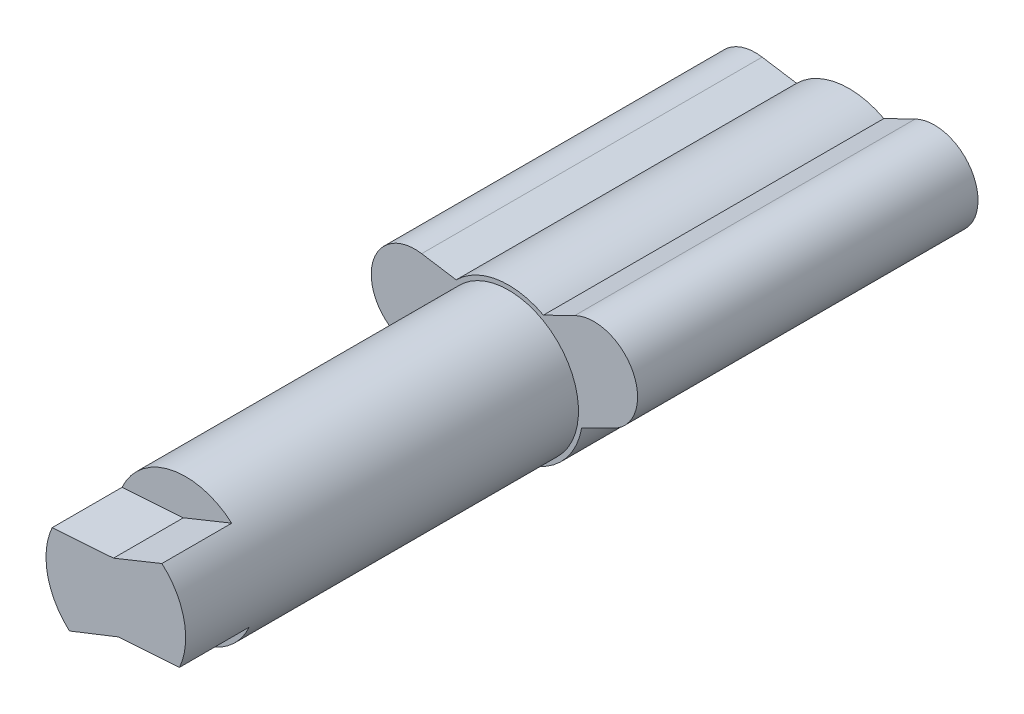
ISO-10303-21;
HEADER;
FILE_DESCRIPTION(('STEP AP214'),'2;1');
FILE_NAME('part.step','',(''),(''),'','','');
FILE_SCHEMA(('AUTOMOTIVE_DESIGN { 1 0 10303 214 1 1 1 1 }'));
ENDSEC;
DATA;
#1=APPLICATION_CONTEXT('core data for automotive mechanical design processes');
#2=APPLICATION_PROTOCOL_DEFINITION('international standard','automotive_design',2000,#1);
#3=PRODUCT_CONTEXT('',#1,'mechanical');
#4=PRODUCT('Part','Part','',(#3));
#5=PRODUCT_RELATED_PRODUCT_CATEGORY('part','',(#4));
#6=PRODUCT_DEFINITION_FORMATION('','',#4);
#7=PRODUCT_DEFINITION_CONTEXT('part definition',#1,'design');
#8=PRODUCT_DEFINITION('design','',#6,#7);
#9=PRODUCT_DEFINITION_SHAPE('','',#8);
#10=(LENGTH_UNIT() NAMED_UNIT(*) SI_UNIT(.MILLI.,.METRE.));
#11=(NAMED_UNIT(*) PLANE_ANGLE_UNIT() SI_UNIT($,.RADIAN.));
#12=(NAMED_UNIT(*) SI_UNIT($,.STERADIAN.) SOLID_ANGLE_UNIT());
#13=UNCERTAINTY_MEASURE_WITH_UNIT(LENGTH_MEASURE(1.E-05),#10,'distance_accuracy_value','');
#14=(GEOMETRIC_REPRESENTATION_CONTEXT(3) GLOBAL_UNCERTAINTY_ASSIGNED_CONTEXT((#13)) GLOBAL_UNIT_ASSIGNED_CONTEXT((#10,
#11,#12)) REPRESENTATION_CONTEXT('',''));
#15=CARTESIAN_POINT('',(0.,0.,0.));
#16=DIRECTION('',(0.,0.,1.));
#17=DIRECTION('',(1.,0.,0.));
#18=AXIS2_PLACEMENT_3D('',#15,#16,#17);
#19=CARTESIAN_POINT('',(-1.72084568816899E-12,6.35602681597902E-12,41.9999999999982));
#20=DIRECTION('',(0.,0.,-0.99999999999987));
#21=DIRECTION('',(-1.0000000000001,0.,0.));
#22=AXIS2_PLACEMENT_3D('',#19,#20,#21);
#23=CYLINDRICAL_SURFACE('',#22,4.);
#24=CARTESIAN_POINT('',(-1.72084568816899E-12,6.35602681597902E-12,41.9999999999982));
#25=DIRECTION('',(0.,0.,0.99999999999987));
#26=DIRECTION('',(1.0000000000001,0.,0.));
#27=AXIS2_PLACEMENT_3D('',#24,#25,#26);
#28=CIRCLE('',#27,4.);
#29=CARTESIAN_POINT('',(-3.64734960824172,1.64220608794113,41.9999999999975));
#30=VERTEX_POINT('',#29);
#31=CARTESIAN_POINT('',(-2.65782858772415,-2.98930547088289,41.9999999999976));
#32=VERTEX_POINT('',#31);
#33=EDGE_CURVE('E258',#30,#32,#28,.T.);
#34=ORIENTED_EDGE('',*,*,#33,.F.);
#35=DIRECTION('',(0.,0.,0.99999999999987));
#36=VECTOR('',#35,1.);
#37=CARTESIAN_POINT('',(-3.64734960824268,1.64220608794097,37.9999999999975));
#38=LINE('',#37,#36);
#39=CARTESIAN_POINT('',(-3.64734960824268,1.64220608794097,37.9999999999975));
#40=VERTEX_POINT('',#39);
#41=EDGE_CURVE('E236',#40,#30,#38,.T.);
#42=ORIENTED_EDGE('',*,*,#41,.F.);
#43=CARTESIAN_POINT('',(-1.81105130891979E-12,1.88737914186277E-12,37.9999999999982));
#44=DIRECTION('',(0.,0.,0.99999999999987));
#45=DIRECTION('',(-1.0000000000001,0.,0.));
#46=AXIS2_PLACEMENT_3D('',#43,#44,#45);
#47=CIRCLE('',#46,4.00000000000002);
#48=CARTESIAN_POINT('',(2.63845152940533,3.00642204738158,37.9999999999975));
#49=VERTEX_POINT('',#48);
#50=EDGE_CURVE('E232',#49,#40,#47,.T.);
#51=ORIENTED_EDGE('',*,*,#50,.F.);
#52=DIRECTION('',(0.,0.,0.99999999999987));
#53=VECTOR('',#52,1.);
#54=CARTESIAN_POINT('',(2.63845152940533,3.00642204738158,37.9999999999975));
#55=LINE('',#54,#53);
#56=CARTESIAN_POINT('',(2.63845152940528,3.00642204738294,41.9999999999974));
#57=VERTEX_POINT('',#56);
#58=EDGE_CURVE('E239',#49,#57,#55,.T.);
#59=ORIENTED_EDGE('',*,*,#58,.T.);
#60=CARTESIAN_POINT('',(3.64734960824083,-1.64220608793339,41.9999999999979));
#61=VERTEX_POINT('',#60);
#62=EDGE_CURVE('E54',#61,#57,#28,.T.);
#63=ORIENTED_EDGE('',*,*,#62,.F.);
#64=DIRECTION('',(0.,0.,0.99999999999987));
#65=VECTOR('',#64,1.);
#66=CARTESIAN_POINT('',(3.64734960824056,-1.64220608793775,37.9999999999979));
#67=LINE('',#66,#65);
#68=CARTESIAN_POINT('',(3.64734960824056,-1.64220608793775,37.9999999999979));
#69=VERTEX_POINT('',#68);
#70=EDGE_CURVE('E69',#69,#61,#67,.T.);
#71=ORIENTED_EDGE('',*,*,#70,.F.);
#72=CARTESIAN_POINT('',(-1.81105130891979E-12,1.88737914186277E-12,37.9999999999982));
#73=DIRECTION('',(0.,0.,0.99999999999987));
#74=DIRECTION('',(1.0000000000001,0.,0.));
#75=AXIS2_PLACEMENT_3D('',#72,#73,#74);
#76=CIRCLE('',#75,3.99999999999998);
#77=CARTESIAN_POINT('',(-2.65782858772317,-2.98930547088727,37.9999999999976));
#78=VERTEX_POINT('',#77);
#79=EDGE_CURVE('E250',#78,#69,#76,.T.);
#80=ORIENTED_EDGE('',*,*,#79,.F.);
#81=DIRECTION('',(0.,0.,0.99999999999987));
#82=VECTOR('',#81,1.);
#83=CARTESIAN_POINT('',(-2.65782858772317,-2.98930547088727,37.9999999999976));
#84=LINE('',#83,#82);
#85=EDGE_CURVE('E255',#78,#32,#84,.T.);
#86=ORIENTED_EDGE('',*,*,#85,.T.);
#87=EDGE_LOOP('',(#34,#42,#51,#59,#63,#71,#80,#86));
#88=FACE_BOUND('',#87,.T.);
#89=CARTESIAN_POINT('',(3.19189119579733E-13,-4.71844785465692E-13,19.499999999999));
#90=DIRECTION('',(0.,0.,-0.99999999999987));
#91=DIRECTION('',(-1.0000000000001,0.,0.));
#92=AXIS2_PLACEMENT_3D('',#89,#90,#91);
#93=CIRCLE('',#92,4.);
#94=CARTESIAN_POINT('',(-4.00000000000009,-4.48974191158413E-13,19.499999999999));
#95=VERTEX_POINT('',#94);
#96=EDGE_CURVE('E13',#95,#95,#93,.T.);
#97=ORIENTED_EDGE('',*,*,#96,.F.);
#98=EDGE_LOOP('',(#97));
#99=FACE_BOUND('',#98,.T.);
#100=ADVANCED_FACE('F47',(#88,#99),#23,.T.);
#101=CARTESIAN_POINT('',(-1.72084568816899E-12,6.35602681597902E-12,41.9999999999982));
#102=DIRECTION('',(0.,0.,0.99999999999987));
#103=DIRECTION('',(1.0000000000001,0.,0.));
#104=AXIS2_PLACEMENT_3D('',#101,#102,#103);
#105=PLANE('',#104);
#106=DIRECTION('',(0.997564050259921,0.0697564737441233,0.));
#107=VECTOR('',#106,1.);
#108=CARTESIAN_POINT('',(-0.132023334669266,1.88802164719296,41.9999999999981));
#109=LINE('',#108,#107);
#110=CARTESIAN_POINT('',(-0.132023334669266,1.88802164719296,41.9999999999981));
#111=VERTEX_POINT('',#110);
#112=EDGE_CURVE('E61',#30,#111,#109,.T.);
#113=ORIENTED_EDGE('',*,*,#112,.F.);
#114=ORIENTED_EDGE('',*,*,#33,.T.);
#115=DIRECTION('',(-0.930152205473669,-0.367174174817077,0.));
#116=VECTOR('',#115,1.);
#117=CARTESIAN_POINT('',(0.132023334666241,-1.88802164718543,41.9999999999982));
#118=LINE('',#117,#116);
#119=CARTESIAN_POINT('',(0.132023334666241,-1.88802164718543,41.9999999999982));
#120=VERTEX_POINT('',#119);
#121=EDGE_CURVE('E238',#120,#32,#118,.T.);
#122=ORIENTED_EDGE('',*,*,#121,.F.);
#123=DIRECTION('',(-0.997564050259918,-0.0697564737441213,0.));
#124=VECTOR('',#123,1.);
#125=CARTESIAN_POINT('',(0.132023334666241,-1.88802164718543,41.9999999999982));
#126=LINE('',#125,#124);
#127=EDGE_CURVE('E245',#61,#120,#126,.T.);
#128=ORIENTED_EDGE('',*,*,#127,.F.);
#129=ORIENTED_EDGE('',*,*,#62,.T.);
#130=DIRECTION('',(0.927293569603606,0.374334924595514,0.));
#131=VECTOR('',#130,1.);
#132=CARTESIAN_POINT('',(-0.132023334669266,1.88802164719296,41.9999999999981));
#133=LINE('',#132,#131);
#134=EDGE_CURVE('E224',#111,#57,#133,.T.);
#135=ORIENTED_EDGE('',*,*,#134,.F.);
#136=EDGE_LOOP('',(#113,#114,#122,#128,#129,#135));
#137=FACE_BOUND('',#136,.T.);
#138=ADVANCED_FACE('F267',(#137),#105,.T.);
#139=CARTESIAN_POINT('',(0.132023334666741,-1.8880216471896,37.9999999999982));
#140=DIRECTION('',(-0.367174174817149,0.930152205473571,0.));
#141=DIRECTION('',(-0.930152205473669,-0.367174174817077,0.));
#142=AXIS2_PLACEMENT_3D('',#139,#140,#141);
#143=PLANE('',#142);
#144=ORIENTED_EDGE('',*,*,#121,.T.);
#145=ORIENTED_EDGE('',*,*,#85,.F.);
#146=DIRECTION('',(-0.930152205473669,-0.367174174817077,0.));
#147=VECTOR('',#146,1.);
#148=CARTESIAN_POINT('',(0.132023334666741,-1.8880216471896,37.9999999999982));
#149=LINE('',#148,#147);
#150=CARTESIAN_POINT('',(0.132023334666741,-1.8880216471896,37.9999999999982));
#151=VERTEX_POINT('',#150);
#152=EDGE_CURVE('E247',#151,#78,#149,.T.);
#153=ORIENTED_EDGE('',*,*,#152,.F.);
#154=DIRECTION('',(0.,0.,0.99999999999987));
#155=VECTOR('',#154,1.);
#156=CARTESIAN_POINT('',(0.132023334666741,-1.8880216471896,37.9999999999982));
#157=LINE('',#156,#155);
#158=EDGE_CURVE('E256',#151,#120,#157,.T.);
#159=ORIENTED_EDGE('',*,*,#158,.T.);
#160=EDGE_LOOP('',(#144,#145,#153,#159));
#161=FACE_BOUND('',#160,.T.);
#162=ADVANCED_FACE('F271',(#161),#143,.F.);
#163=CARTESIAN_POINT('',(0.132023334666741,-1.8880216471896,37.9999999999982));
#164=DIRECTION('',(-0.0697564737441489,0.997564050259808,0.));
#165=DIRECTION('',(-0.997564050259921,-0.0697564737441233,0.));
#166=AXIS2_PLACEMENT_3D('',#163,#164,#165);
#167=PLANE('',#166);
#168=ORIENTED_EDGE('',*,*,#127,.T.);
#169=ORIENTED_EDGE('',*,*,#158,.F.);
#170=DIRECTION('',(-0.997564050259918,-0.0697564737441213,0.));
#171=VECTOR('',#170,1.);
#172=CARTESIAN_POINT('',(0.132023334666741,-1.8880216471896,37.9999999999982));
#173=LINE('',#172,#171);
#174=EDGE_CURVE('E252',#69,#151,#173,.T.);
#175=ORIENTED_EDGE('',*,*,#174,.F.);
#176=ORIENTED_EDGE('',*,*,#70,.T.);
#177=EDGE_LOOP('',(#168,#169,#175,#176));
#178=FACE_BOUND('',#177,.T.);
#179=ADVANCED_FACE('F277',(#178),#167,.F.);
#180=CARTESIAN_POINT('',(-1.81105130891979E-12,1.88737914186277E-12,37.9999999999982));
#181=DIRECTION('',(0.,0.,0.99999999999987));
#182=DIRECTION('',(1.0000000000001,0.,0.));
#183=AXIS2_PLACEMENT_3D('',#180,#181,#182);
#184=PLANE('',#183);
#185=ORIENTED_EDGE('',*,*,#152,.T.);
#186=ORIENTED_EDGE('',*,*,#79,.T.);
#187=ORIENTED_EDGE('',*,*,#174,.T.);
#188=EDGE_LOOP('',(#185,#186,#187));
#189=FACE_BOUND('',#188,.T.);
#190=ADVANCED_FACE('F276',(#189),#184,.T.);
#191=CARTESIAN_POINT('',(-0.132023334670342,1.88802164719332,37.9999999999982));
#192=DIRECTION('',(0.0697564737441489,-0.997564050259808,0.));
#193=DIRECTION('',(0.997564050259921,0.0697564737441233,0.));
#194=AXIS2_PLACEMENT_3D('',#191,#192,#193);
#195=PLANE('',#194);
#196=ORIENTED_EDGE('',*,*,#112,.T.);
#197=DIRECTION('',(0.,0.,0.99999999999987));
#198=VECTOR('',#197,1.);
#199=CARTESIAN_POINT('',(-0.132023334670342,1.88802164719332,37.9999999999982));
#200=LINE('',#199,#198);
#201=CARTESIAN_POINT('',(-0.132023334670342,1.88802164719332,37.9999999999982));
#202=VERTEX_POINT('',#201);
#203=EDGE_CURVE('E235',#202,#111,#200,.T.);
#204=ORIENTED_EDGE('',*,*,#203,.F.);
#205=DIRECTION('',(0.997564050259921,0.0697564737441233,0.));
#206=VECTOR('',#205,1.);
#207=CARTESIAN_POINT('',(-0.132023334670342,1.88802164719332,37.9999999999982));
#208=LINE('',#207,#206);
#209=EDGE_CURVE('E226',#40,#202,#208,.T.);
#210=ORIENTED_EDGE('',*,*,#209,.F.);
#211=ORIENTED_EDGE('',*,*,#41,.T.);
#212=EDGE_LOOP('',(#196,#204,#210,#211));
#213=FACE_BOUND('',#212,.T.);
#214=ADVANCED_FACE('F284',(#213),#195,.F.);
#215=CARTESIAN_POINT('',(-0.132023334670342,1.88802164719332,37.9999999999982));
#216=DIRECTION('',(0.37433492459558,-0.92729356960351,0.));
#217=DIRECTION('',(0.927293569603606,0.374334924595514,0.));
#218=AXIS2_PLACEMENT_3D('',#215,#216,#217);
#219=PLANE('',#218);
#220=ORIENTED_EDGE('',*,*,#134,.T.);
#221=ORIENTED_EDGE('',*,*,#58,.F.);
#222=DIRECTION('',(0.927293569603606,0.374334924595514,0.));
#223=VECTOR('',#222,1.);
#224=CARTESIAN_POINT('',(-0.132023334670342,1.88802164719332,37.9999999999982));
#225=LINE('',#224,#223);
#226=EDGE_CURVE('E229',#202,#49,#225,.T.);
#227=ORIENTED_EDGE('',*,*,#226,.F.);
#228=ORIENTED_EDGE('',*,*,#203,.T.);
#229=EDGE_LOOP('',(#220,#221,#227,#228));
#230=FACE_BOUND('',#229,.T.);
#231=ADVANCED_FACE('F281',(#230),#219,.F.);
#232=CARTESIAN_POINT('',(-1.81105130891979E-12,1.88737914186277E-12,37.9999999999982));
#233=DIRECTION('',(0.,0.,-0.99999999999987));
#234=DIRECTION('',(-1.0000000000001,0.,0.));
#235=AXIS2_PLACEMENT_3D('',#232,#233,#234);
#236=PLANE('',#235);
#237=ORIENTED_EDGE('',*,*,#209,.T.);
#238=ORIENTED_EDGE('',*,*,#226,.T.);
#239=ORIENTED_EDGE('',*,*,#50,.T.);
#240=EDGE_LOOP('',(#237,#238,#239));
#241=FACE_BOUND('',#240,.T.);
#242=ADVANCED_FACE('F283',(#241),#236,.F.);
#243=CARTESIAN_POINT('',(3.19189119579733E-13,-4.71844785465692E-13,19.499999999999));
#244=DIRECTION('',(0.,0.,-0.99999999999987));
#245=DIRECTION('',(-1.0000000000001,0.,0.));
#246=AXIS2_PLACEMENT_3D('',#243,#244,#245);
#247=PLANE('',#246);
#248=CARTESIAN_POINT('',(3.19189119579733E-13,-4.71844785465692E-13,19.499999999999));
#249=DIRECTION('',(0.,0.,-0.99999999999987));
#250=DIRECTION('',(-1.0000000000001,0.,0.));
#251=AXIS2_PLACEMENT_3D('',#248,#249,#250);
#252=CIRCLE('',#251,4.25);
#253=CARTESIAN_POINT('',(4.18533999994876,-0.738531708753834,19.4999999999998));
#254=VERTEX_POINT('',#253);
#255=CARTESIAN_POINT('',(-3.78487172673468,-1.93319580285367,19.5000000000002));
#256=VERTEX_POINT('',#255);
#257=EDGE_CURVE('E156',#254,#256,#252,.T.);
#258=ORIENTED_EDGE('',*,*,#257,.F.);
#259=DIRECTION('',(-0.898605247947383,-0.438758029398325,0.));
#260=VECTOR('',#259,1.);
#261=CARTESIAN_POINT('',(4.18533999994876,-0.738531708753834,19.4999999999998));
#262=LINE('',#261,#260);
#263=CARTESIAN_POINT('',(5.98255049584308,0.13898435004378,19.4999999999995));
#264=VERTEX_POINT('',#263);
#265=EDGE_CURVE('E161',#264,#254,#262,.T.);
#266=ORIENTED_EDGE('',*,*,#265,.F.);
#267=CARTESIAN_POINT('',(4.88565542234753,2.38549746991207,19.499999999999));
#268=DIRECTION('',(0.,0.,-0.99999999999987));
#269=DIRECTION('',(1.0000000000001,0.,0.));
#270=AXIS2_PLACEMENT_3D('',#267,#268,#269);
#271=CIRCLE('',#270,2.5);
#272=CARTESIAN_POINT('',(3.78876034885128,4.6320105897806,19.4999999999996));
#273=VERTEX_POINT('',#272);
#274=EDGE_CURVE('E205',#273,#264,#271,.T.);
#275=ORIENTED_EDGE('',*,*,#274,.F.);
#276=DIRECTION('',(0.898605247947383,0.438758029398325,0.));
#277=VECTOR('',#276,1.);
#278=CARTESIAN_POINT('',(3.78876034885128,4.6320105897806,19.4999999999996));
#279=LINE('',#278,#277);
#280=CARTESIAN_POINT('',(1.99154985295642,3.75449453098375,19.4999999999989));
#281=VERTEX_POINT('',#280);
#282=EDGE_CURVE('E202',#281,#273,#279,.T.);
#283=ORIENTED_EDGE('',*,*,#282,.F.);
#284=CARTESIAN_POINT('',(3.19189119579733E-13,-4.71844785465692E-13,19.499999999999));
#285=DIRECTION('',(0.,0.,-0.99999999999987));
#286=DIRECTION('',(-1.0000000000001,0.,0.));
#287=AXIS2_PLACEMENT_3D('',#284,#285,#286);
#288=CIRCLE('',#287,4.25);
#289=CARTESIAN_POINT('',(-3.00482543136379,3.00558216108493,19.499999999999));
#290=VERTEX_POINT('',#289);
#291=EDGE_CURVE('E199',#290,#281,#288,.T.);
#292=ORIENTED_EDGE('',*,*,#291,.F.);
#293=DIRECTION('',(0.987755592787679,-0.156009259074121,0.));
#294=VECTOR('',#293,1.);
#295=CARTESIAN_POINT('',(-3.00482543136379,3.00558216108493,19.499999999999));
#296=LINE('',#295,#294);
#297=CARTESIAN_POINT('',(-4.98033661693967,3.31760067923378,19.499999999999));
#298=VERTEX_POINT('',#297);
#299=EDGE_CURVE('E196',#298,#290,#296,.T.);
#300=ORIENTED_EDGE('',*,*,#299,.F.);
#301=CARTESIAN_POINT('',(-5.37035976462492,0.848211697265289,19.499999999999));
#302=DIRECTION('',(0.,0.,-0.99999999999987));
#303=DIRECTION('',(1.0000000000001,0.,0.));
#304=AXIS2_PLACEMENT_3D('',#301,#302,#303);
#305=CIRCLE('',#304,2.5);
#306=CARTESIAN_POINT('',(-5.7603829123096,-1.62117728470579,19.5000000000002));
#307=VERTEX_POINT('',#306);
#308=EDGE_CURVE('E193',#307,#298,#305,.T.);
#309=ORIENTED_EDGE('',*,*,#308,.F.);
#310=DIRECTION('',(-0.98775559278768,0.156009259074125,0.));
#311=VECTOR('',#310,1.);
#312=CARTESIAN_POINT('',(-5.7603829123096,-1.62117728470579,19.5000000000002));
#313=LINE('',#312,#311);
#314=EDGE_CURVE('E191',#256,#307,#313,.T.);
#315=ORIENTED_EDGE('',*,*,#314,.F.);
#316=EDGE_LOOP('',(#258,#266,#275,#283,#292,#300,#309,#315));
#317=FACE_BOUND('',#316,.T.);
#318=ORIENTED_EDGE('',*,*,#96,.T.);
#319=EDGE_LOOP('',(#318));
#320=FACE_BOUND('',#319,.T.);
#321=ADVANCED_FACE('F325',(#317,#320),#247,.F.);
#322=CARTESIAN_POINT('',(3.19189119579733E-13,-4.71844785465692E-13,19.499999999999));
#323=DIRECTION('',(0.,0.,-0.99999999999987));
#324=DIRECTION('',(-1.0000000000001,0.,0.));
#325=AXIS2_PLACEMENT_3D('',#322,#323,#324);
#326=CYLINDRICAL_SURFACE('',#325,4.25);
#327=CARTESIAN_POINT('',(0.,0.,0.));
#328=DIRECTION('',(0.,0.,-0.99999999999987));
#329=DIRECTION('',(-1.0000000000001,0.,0.));
#330=AXIS2_PLACEMENT_3D('',#327,#328,#329);
#331=CIRCLE('',#330,4.25);
#332=CARTESIAN_POINT('',(4.1853399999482,-0.738531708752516,3.41393580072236E-12));
#333=VERTEX_POINT('',#332);
#334=CARTESIAN_POINT('',(-3.78487172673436,-1.93319580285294,3.05311331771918E-12));
#335=VERTEX_POINT('',#334);
#336=EDGE_CURVE('E153',#333,#335,#331,.T.);
#337=ORIENTED_EDGE('',*,*,#336,.F.);
#338=DIRECTION('',(0.,0.,-0.99999999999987));
#339=VECTOR('',#338,1.);
#340=CARTESIAN_POINT('',(4.18533999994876,-0.738531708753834,19.4999999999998));
#341=LINE('',#340,#339);
#342=EDGE_CURVE('E210',#254,#333,#341,.T.);
#343=ORIENTED_EDGE('',*,*,#342,.F.);
#344=ORIENTED_EDGE('',*,*,#257,.T.);
#345=DIRECTION('',(0.,0.,-0.99999999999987));
#346=VECTOR('',#345,1.);
#347=CARTESIAN_POINT('',(-3.78487172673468,-1.93319580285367,19.5000000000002));
#348=LINE('',#347,#346);
#349=EDGE_CURVE('E149',#256,#335,#348,.T.);
#350=ORIENTED_EDGE('',*,*,#349,.T.);
#351=EDGE_LOOP('',(#337,#343,#344,#350));
#352=FACE_BOUND('',#351,.T.);
#353=ADVANCED_FACE('F151',(#352),#326,.T.);
#354=CARTESIAN_POINT('',(4.18533999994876,-0.738531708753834,19.4999999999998));
#355=DIRECTION('',(0.438758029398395,-0.898605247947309,0.));
#356=DIRECTION('',(0.898605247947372,0.438758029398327,0.));
#357=AXIS2_PLACEMENT_3D('',#354,#355,#356);
#358=PLANE('',#357);
#359=DIRECTION('',(-0.898605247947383,-0.438758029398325,0.));
#360=VECTOR('',#359,1.);
#361=CARTESIAN_POINT('',(4.1853399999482,-0.738531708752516,3.41393580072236E-12));
#362=LINE('',#361,#360);
#363=CARTESIAN_POINT('',(5.98255049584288,0.138984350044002,3.37230243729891E-12));
#364=VERTEX_POINT('',#363);
#365=EDGE_CURVE('E174',#364,#333,#362,.T.);
#366=ORIENTED_EDGE('',*,*,#365,.F.);
#367=DIRECTION('',(0.,0.,-0.99999999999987));
#368=VECTOR('',#367,1.);
#369=CARTESIAN_POINT('',(5.98255049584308,0.13898435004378,19.4999999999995));
#370=LINE('',#369,#368);
#371=EDGE_CURVE('E212',#264,#364,#370,.T.);
#372=ORIENTED_EDGE('',*,*,#371,.F.);
#373=ORIENTED_EDGE('',*,*,#265,.T.);
#374=ORIENTED_EDGE('',*,*,#342,.T.);
#375=EDGE_LOOP('',(#366,#372,#373,#374));
#376=FACE_BOUND('',#375,.T.);
#377=ADVANCED_FACE('F342',(#376),#358,.T.);
#378=CARTESIAN_POINT('',(4.88565542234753,2.38549746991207,19.499999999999));
#379=DIRECTION('',(0.,0.,-0.99999999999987));
#380=DIRECTION('',(-1.0000000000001,0.,0.));
#381=AXIS2_PLACEMENT_3D('',#378,#379,#380);
#382=CYLINDRICAL_SURFACE('',#381,2.5);
#383=CARTESIAN_POINT('',(4.88565542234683,2.38549746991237,5.27355936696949E-13));
#384=DIRECTION('',(0.,0.,-0.99999999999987));
#385=DIRECTION('',(1.0000000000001,0.,0.));
#386=AXIS2_PLACEMENT_3D('',#383,#384,#385);
#387=CIRCLE('',#386,2.5);
#388=CARTESIAN_POINT('',(3.7887603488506,4.63201058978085,1.11022302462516E-13));
#389=VERTEX_POINT('',#388);
#390=EDGE_CURVE('E187',#389,#364,#387,.T.);
#391=ORIENTED_EDGE('',*,*,#390,.F.);
#392=DIRECTION('',(0.,0.,-0.99999999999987));
#393=VECTOR('',#392,1.);
#394=CARTESIAN_POINT('',(3.78876034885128,4.6320105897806,19.4999999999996));
#395=LINE('',#394,#393);
#396=EDGE_CURVE('E214',#273,#389,#395,.T.);
#397=ORIENTED_EDGE('',*,*,#396,.F.);
#398=ORIENTED_EDGE('',*,*,#274,.T.);
#399=ORIENTED_EDGE('',*,*,#371,.T.);
#400=EDGE_LOOP('',(#391,#397,#398,#399));
#401=FACE_BOUND('',#400,.T.);
#402=ADVANCED_FACE('F349',(#401),#382,.T.);
#403=CARTESIAN_POINT('',(3.78876034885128,4.6320105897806,19.4999999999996));
#404=DIRECTION('',(-0.438758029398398,0.898605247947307,0.));
#405=DIRECTION('',(-0.898605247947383,-0.438758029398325,0.));
#406=AXIS2_PLACEMENT_3D('',#403,#404,#405);
#407=PLANE('',#406);
#408=DIRECTION('',(0.898605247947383,0.438758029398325,0.));
#409=VECTOR('',#408,1.);
#410=CARTESIAN_POINT('',(3.7887603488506,4.63201058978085,1.11022302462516E-13));
#411=LINE('',#410,#409);
#412=CARTESIAN_POINT('',(1.99154985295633,3.75449453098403,3.02535774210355E-12));
#413=VERTEX_POINT('',#412);
#414=EDGE_CURVE('E184',#413,#389,#411,.T.);
#415=ORIENTED_EDGE('',*,*,#414,.F.);
#416=DIRECTION('',(0.,0.,-0.99999999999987));
#417=VECTOR('',#416,1.);
#418=CARTESIAN_POINT('',(1.99154985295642,3.75449453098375,19.4999999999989));
#419=LINE('',#418,#417);
#420=EDGE_CURVE('E216',#281,#413,#419,.T.);
#421=ORIENTED_EDGE('',*,*,#420,.F.);
#422=ORIENTED_EDGE('',*,*,#282,.T.);
#423=ORIENTED_EDGE('',*,*,#396,.T.);
#424=EDGE_LOOP('',(#415,#421,#422,#423));
#425=FACE_BOUND('',#424,.T.);
#426=ADVANCED_FACE('F357',(#425),#407,.T.);
#427=CARTESIAN_POINT('',(3.19189119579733E-13,-4.71844785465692E-13,19.499999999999));
#428=DIRECTION('',(0.,0.,-0.99999999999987));
#429=DIRECTION('',(-1.0000000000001,0.,0.));
#430=AXIS2_PLACEMENT_3D('',#427,#428,#429);
#431=CYLINDRICAL_SURFACE('',#430,4.25);
#432=CARTESIAN_POINT('',(0.,0.,0.));
#433=DIRECTION('',(0.,0.,-0.99999999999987));
#434=DIRECTION('',(-1.0000000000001,0.,0.));
#435=AXIS2_PLACEMENT_3D('',#432,#433,#434);
#436=CIRCLE('',#435,4.25);
#437=CARTESIAN_POINT('',(-3.00482543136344,3.00558216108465,3.03923552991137E-12));
#438=VERTEX_POINT('',#437);
#439=EDGE_CURVE('E181',#438,#413,#436,.T.);
#440=ORIENTED_EDGE('',*,*,#439,.F.);
#441=DIRECTION('',(0.,0.,-0.99999999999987));
#442=VECTOR('',#441,1.);
#443=CARTESIAN_POINT('',(-3.00482543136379,3.00558216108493,19.499999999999));
#444=LINE('',#443,#442);
#445=EDGE_CURVE('E218',#290,#438,#444,.T.);
#446=ORIENTED_EDGE('',*,*,#445,.F.);
#447=ORIENTED_EDGE('',*,*,#291,.T.);
#448=ORIENTED_EDGE('',*,*,#420,.T.);
#449=EDGE_LOOP('',(#440,#446,#447,#448));
#450=FACE_BOUND('',#449,.T.);
#451=ADVANCED_FACE('F365',(#450),#431,.T.);
#452=CARTESIAN_POINT('',(-3.00482543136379,3.00558216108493,19.499999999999));
#453=DIRECTION('',(0.156009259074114,0.987755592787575,0.));
#454=DIRECTION('',(-0.987755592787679,0.156009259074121,0.));
#455=AXIS2_PLACEMENT_3D('',#452,#453,#454);
#456=PLANE('',#455);
#457=DIRECTION('',(0.987755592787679,-0.156009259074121,0.));
#458=VECTOR('',#457,1.);
#459=CARTESIAN_POINT('',(-3.0048254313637,3.00558216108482,3.03923552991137E-12));
#460=LINE('',#459,#458);
#461=CARTESIAN_POINT('',(-4.98033661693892,3.31760067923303,-2.4008572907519E-12));
#462=VERTEX_POINT('',#461);
#463=EDGE_CURVE('E178',#462,#438,#460,.T.);
#464=ORIENTED_EDGE('',*,*,#463,.F.);
#465=DIRECTION('',(0.,0.,-0.99999999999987));
#466=VECTOR('',#465,1.);
#467=CARTESIAN_POINT('',(-4.98033661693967,3.31760067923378,19.499999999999));
#468=LINE('',#467,#466);
#469=EDGE_CURVE('E220',#298,#462,#468,.T.);
#470=ORIENTED_EDGE('',*,*,#469,.F.);
#471=ORIENTED_EDGE('',*,*,#299,.T.);
#472=ORIENTED_EDGE('',*,*,#445,.T.);
#473=EDGE_LOOP('',(#464,#470,#471,#472));
#474=FACE_BOUND('',#473,.T.);
#475=ADVANCED_FACE('F373',(#474),#456,.T.);
#476=CARTESIAN_POINT('',(-5.37035976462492,0.848211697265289,19.499999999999));
#477=DIRECTION('',(0.,0.,-0.99999999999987));
#478=DIRECTION('',(-1.0000000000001,0.,0.));
#479=AXIS2_PLACEMENT_3D('',#476,#477,#478);
#480=CYLINDRICAL_SURFACE('',#479,2.5);
#481=CARTESIAN_POINT('',(-5.37035976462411,0.848211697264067,3.05311331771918E-12));
#482=DIRECTION('',(0.,0.,-0.99999999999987));
#483=DIRECTION('',(1.0000000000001,0.,0.));
#484=AXIS2_PLACEMENT_3D('',#481,#482,#483);
#485=CIRCLE('',#484,2.5);
#486=CARTESIAN_POINT('',(-5.7603829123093,-1.62117728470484,3.41393580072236E-12));
#487=VERTEX_POINT('',#486);
#488=EDGE_CURVE('E169',#487,#462,#485,.T.);
#489=ORIENTED_EDGE('',*,*,#488,.F.);
#490=DIRECTION('',(0.,0.,-0.99999999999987));
#491=VECTOR('',#490,1.);
#492=CARTESIAN_POINT('',(-5.7603829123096,-1.62117728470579,19.5000000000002));
#493=LINE('',#492,#491);
#494=EDGE_CURVE('E160',#307,#487,#493,.T.);
#495=ORIENTED_EDGE('',*,*,#494,.F.);
#496=ORIENTED_EDGE('',*,*,#308,.T.);
#497=ORIENTED_EDGE('',*,*,#469,.T.);
#498=EDGE_LOOP('',(#489,#495,#496,#497));
#499=FACE_BOUND('',#498,.T.);
#500=ADVANCED_FACE('F381',(#499),#480,.T.);
#501=CARTESIAN_POINT('',(-5.7603829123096,-1.62117728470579,19.5000000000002));
#502=DIRECTION('',(-0.156009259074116,-0.987755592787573,0.));
#503=DIRECTION('',(0.98775559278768,-0.156009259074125,0.));
#504=AXIS2_PLACEMENT_3D('',#501,#502,#503);
#505=PLANE('',#504);
#506=DIRECTION('',(-0.98775559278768,0.156009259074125,0.));
#507=VECTOR('',#506,1.);
#508=CARTESIAN_POINT('',(-5.7603829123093,-1.62117728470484,3.41393580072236E-12));
#509=LINE('',#508,#507);
#510=EDGE_CURVE('E164',#335,#487,#509,.T.);
#511=ORIENTED_EDGE('',*,*,#510,.F.);
#512=ORIENTED_EDGE('',*,*,#349,.F.);
#513=ORIENTED_EDGE('',*,*,#314,.T.);
#514=ORIENTED_EDGE('',*,*,#494,.T.);
#515=EDGE_LOOP('',(#511,#512,#513,#514));
#516=FACE_BOUND('',#515,.T.);
#517=ADVANCED_FACE('F165',(#516),#505,.T.);
#518=CARTESIAN_POINT('',(0.,0.,0.));
#519=DIRECTION('',(0.,0.,0.99999999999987));
#520=DIRECTION('',(1.0000000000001,0.,0.));
#521=AXIS2_PLACEMENT_3D('',#518,#519,#520);
#522=PLANE('',#521);
#523=ORIENTED_EDGE('',*,*,#336,.T.);
#524=ORIENTED_EDGE('',*,*,#510,.T.);
#525=ORIENTED_EDGE('',*,*,#488,.T.);
#526=ORIENTED_EDGE('',*,*,#463,.T.);
#527=ORIENTED_EDGE('',*,*,#439,.T.);
#528=ORIENTED_EDGE('',*,*,#414,.T.);
#529=ORIENTED_EDGE('',*,*,#390,.T.);
#530=ORIENTED_EDGE('',*,*,#365,.T.);
#531=EDGE_LOOP('',(#523,#524,#525,#526,#527,#528,#529,#530));
#532=FACE_BOUND('',#531,.T.);
#533=ADVANCED_FACE('F171',(#532),#522,.F.);
#534=CLOSED_SHELL('',(#100,#138,#162,#179,#190,#214,#231,#242,#321,#353,#377,#402,#426,#451,
#475,#500,#517,#533));
#535=MANIFOLD_SOLID_BREP('B2',#534);
#536=ADVANCED_BREP_SHAPE_REPRESENTATION('',(#18,#535),#14);
#537=SHAPE_DEFINITION_REPRESENTATION(#9,#536);
ENDSEC;
END-ISO-10303-21;
